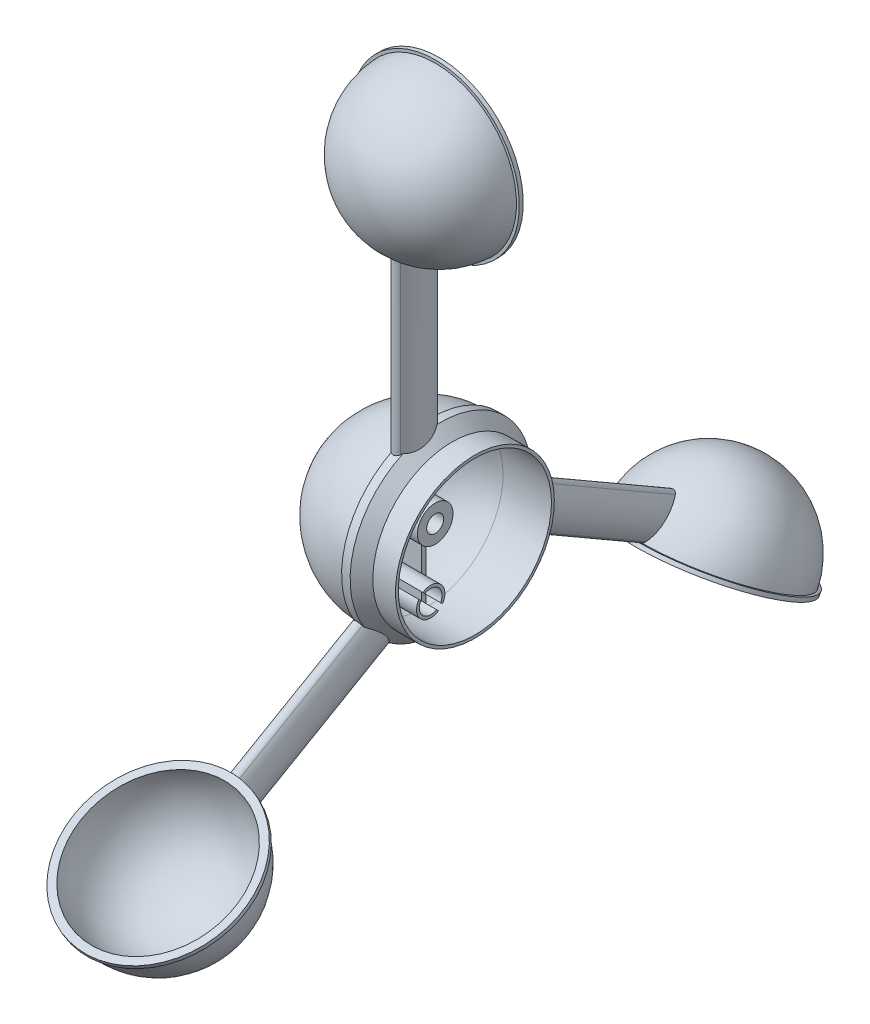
from build123d import *

# Parameters (mm, degrees)
LOGEMENT_AIMANT_REACH          = 35.522
ESQUISSE6_R                    = 2.5
ESQUISSE6_R_2                  = 2
RAINURE_DEPTH                  = 10
MOYEU_D_AXE_REACH              = 30.748
MOYEU_D_AXE_END_RADIUS         = 12.701536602
ESQUISSE8_R                    = 3.15
NERVURE_REACH                  = 29.56
R_P_TITION_NERVURE_COUNT       = 2
R_P_TITION_NERVURE_ANGLE       = 150
BRAS_DEPTH                     = 33
ESQUISSE5_R                    = 13.9
LOGEMENT_DE_LA_COUPELLE_DEPTH  = 5
R_P_TITION_DES_BRAS_COUNT      = 3
R_P_TITION_DES_COUPELLES_COUNT = 3
ESQUISSE9_R                    = 1.5
AXE_3_DEPTH                    = 15
MATI_RE1_POUR_VIS_REACH        = 101.071
ESQUISSE13_R                   = 3.75
ESQUISSE15_R                   = 0.75
PERCAGE_TROU_D_EAU_DEPTH       = 40
R_P_TITION_CIRCULAIRE1_COUNT   = 3


with BuildPart() as part:
    # Esquisse1 → moyeu (revolve)
    with BuildSketch(Plane.XY, mode=Mode.PRIVATE) as moyeu_sk:
        with BuildLine():
            Line((0, 13.5), (0, 14))
            Line((0, 14), (-4, 14))
            Line((-4, 14), (-6, 16))
            Line((-6, 16), (-7.5, 16))
            Line((-7.5, 16), (-7.5, 15.5))
            ThreePointArc((-7.5, 15.5), (-15.925144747, 13.778968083), (-22.339049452, 8.051242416))
            ThreePointArc((-22.339049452, 8.051242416), (-24.122171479, 4.199871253), (-24.733453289, 0))
            Line((-24.733453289, 0), (-22.701536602, 0))
            ThreePointArc((-22.701536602, 0), (-22.174557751, 3.620659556), (-20.637349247, 6.940881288))
            ThreePointArc((-20.637349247, 6.940881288), (-15.412478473, 11.754936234), (-8.525595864, 13.5))
            Line((-8.525595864, 13.5), (0, 13.5))
        make_face()
    revolve(moyeu_sk.sketch.rotate(Axis((0, 0, 0), (-1, 0, 0)), 90), axis=Axis((0, 0, 0), (-1, 0, 0)))

    # Esquisse6 → logement aimant (add, up to next)
    with BuildSketch(Plane(origin=(0, 0, 0), x_dir=(0, 0, -1), z_dir=(1, 0, 0)), mode=Mode.PRIVATE) as logement_aimant_sk1:
        with Locations((-7.794228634, -4.5)):
            Circle(ESQUISSE6_R)
        with Locations((-7.794228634, -4.5)):
            Circle(ESQUISSE6_R_2, mode=Mode.SUBTRACT)
    logement_aimant_tool1 = extrude(logement_aimant_sk1.sketch, amount=-LOGEMENT_AIMANT_REACH, mode=Mode.PRIVATE) - part.part
    add(logement_aimant_tool1.solids().sort_by_distance((0, -4.5, 10.223518))[0])

    # Esquisse7 → rainure (cut)
    with BuildSketch(Plane(origin=(0, 0, 0), x_dir=(0, 0, -1), z_dir=(1, 0, 0))):
        Polygon((-10.036201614, -2.965133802), (-5.793560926, -7.207774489), (-5.086454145, -6.500667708), (-9.329094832, -2.258027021), align=None)
    extrude(amount=-RAINURE_DEPTH, mode=Mode.SUBTRACT)

    # moyeu d_axe: up to this sphere (the profile starts inside it)
    moyeu_d_axe_end = Location((-10, 0, 0)) * Sphere(MOYEU_D_AXE_END_RADIUS, mode=Mode.PRIVATE)
    # Esquisse8 → moyeu d_axe (add, up to the surface)
    with BuildSketch(Plane(origin=(-7, 0, 0), x_dir=(0, 0, -1), z_dir=(1, 0, 0)), mode=Mode.PRIVATE) as moyeu_d_axe_sk1:
        Circle(ESQUISSE8_R)
    moyeu_d_axe_tool1 = extrude(moyeu_d_axe_sk1.sketch, amount=-MOYEU_D_AXE_REACH, mode=Mode.PRIVATE) & moyeu_d_axe_end
    add(moyeu_d_axe_tool1.solids().sort_by_distance((-7, 0, 0))[0])

    # Esquisse10 → nervure (add, up to next)
    with BuildSketch(Plane(origin=(-9, 0, 0), x_dir=(0, 0, -1), z_dir=(1, 0, 0)), mode=Mode.PRIVATE) as nervure_sk1:
        Polygon((-1.48724054, 1.776825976), (-7.228464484, 11.720917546), (-6.535644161, 12.120917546), (-0.81287182, 2.208785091), align=None)
    nervure_tool1 = extrude(nervure_sk1.sketch, amount=-NERVURE_REACH, mode=Mode.PRIVATE) - part.part
    nervure = nervure_tool1.solids().sort_by_distance((-9, 6.95675, 4.016239))[0]
    add(nervure)

    # R_p_tition nervure: nervure ×2 about axis
    r_p_tition_nervure_axis = Axis((-500000, 0, 0), (1, 0, 0))
    for i in range(1, R_P_TITION_NERVURE_COUNT):
        add(nervure.rotate(r_p_tition_nervure_axis, i * R_P_TITION_NERVURE_ANGLE / (R_P_TITION_NERVURE_COUNT - 1)))

    # Esquisse2 → bras (add)
    with BuildSketch(Plane(origin=(0, 13.5, 0), x_dir=(-1, 0, 0), z_dir=(0, 1, 0))):
        with BuildLine():
            ThreePointArc((7.839224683, 6.943784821), (7.015144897, 7.399885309), (6.177629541, 6.968952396))
            ThreePointArc((6.177629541, 6.968952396), (5.152076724, 3.684077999), (6.177629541, 0.399203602))
            ThreePointArc((6.177629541, 0.399203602), (7.015144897, -0.031729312), (7.839224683, 0.424371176))
            ThreePointArc((7.839224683, 0.424371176), (8.55121093, 1.984576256), (8.781119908, 3.684077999))
            ThreePointArc((8.781119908, 3.684077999), (8.55121093, 5.383579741), (7.839224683, 6.943784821))
        make_face()
    bras = extrude(amount=BRAS_DEPTH)

    # Esquisse5 → logement de la coupelle (cut, symmetric)
    with BuildSketch(Plane(origin=(-7, 0, 0), x_dir=(0, 0, -1), z_dir=(1, 0, 0))):
        with Locations((0, 56)):
            Circle(ESQUISSE5_R)
    logement_de_la_coupelle = extrude(amount=LOGEMENT_DE_LA_COUPELLE_DEPTH, both=True, mode=Mode.SUBTRACT)

    # R_p_tition des bras: bras, logement de la coupelle ×3 about axis
    r_p_tition_des_bras_axis = Axis((0, 0, 0), (1, 0, 0))
    add([bras.rotate(r_p_tition_des_bras_axis, i * 360 / R_P_TITION_DES_BRAS_COUNT) for i in range(1, R_P_TITION_DES_BRAS_COUNT)])
    add([logement_de_la_coupelle.rotate(r_p_tition_des_bras_axis, i * 360 / R_P_TITION_DES_BRAS_COUNT) for i in range(1, R_P_TITION_DES_BRAS_COUNT)], mode=Mode.SUBTRACT)

    # Esquisse3 → coupelle (revolve)
    with BuildSketch(Plane(origin=(-7, 0, 0), x_dir=(0, 0, -1), z_dir=(1, 0, 0))):
        with BuildLine():
            Line((0, 70.32702487), (0, 70.827050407))
            Line((0, 70.827050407), (0.69999966, 70.827739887))
            Line((0.69999966, 70.827739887), (0.69999966, 69.5))
            ThreePointArc((0.69999966, 69.5), (-8.845941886, 65.545941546), (-12.80000034, 56))
            Line((-12.80000034, 56), (-13.644115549, 56))
            ThreePointArc((-13.644115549, 56), (-9.687360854, 65.892238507), (0, 70.32702487))
        make_face()
    coupelle = revolve(axis=Axis((-7, 56, 12.80000034), (0, 0, 1)))

    # R_p_tition des coupelles: coupelle ×3 about axis
    r_p_tition_des_coupelles_axis = Axis((0, 0, 0), (1, 0, 0))
    for i in range(1, R_P_TITION_DES_COUPELLES_COUNT):
        add(coupelle.rotate(r_p_tition_des_coupelles_axis, i * 360 / R_P_TITION_DES_COUPELLES_COUNT))

    # Esquisse9 → axe 3 (cut)
    with BuildSketch(Plane(origin=(-7, 0, 0), x_dir=(0, 0, -1), z_dir=(1, 0, 0))):
        Circle(ESQUISSE9_R)
    extrude(amount=-AXE_3_DEPTH, mode=Mode.SUBTRACT)

    # Esquisse12 → mati_re pour vis (revolve)
    with BuildSketch(Plane(origin=(-17, 0, 0), x_dir=(0, 0, -1), z_dir=(1, 0, 0)), mode=Mode.PRIVATE) as mati_re_pour_vis_sk:
        Polygon((0.269339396, 3.042254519), (6.156606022, 6.44126949), (7.406606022, 4.276205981), (1.519339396, 0.877191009), align=None)
    revolve(mati_re_pour_vis_sk.sketch.rotate(Axis((-17, 0, 0), (0, 0.5000000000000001, -0.8660254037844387)), 230.949877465), axis=Axis((-17, 0, 0), (0, 0.5000000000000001, -0.8660254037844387)))

    # Esquisse13 → mati_re1 pour vis (add, up to next)
    with BuildSketch(Plane(origin=(0, 4.276205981, -7.406606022), x_dir=(-1, 0, 0), z_dir=(0, 0.5000000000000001, -0.8660254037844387)), mode=Mode.PRIVATE) as mati_re1_pour_vis_sk1:
        with Locations((17, 0)):
            Circle(ESQUISSE13_R)
    mati_re1_pour_vis_tool1 = extrude(mati_re1_pour_vis_sk1.sketch, amount=MATI_RE1_POUR_VIS_REACH, mode=Mode.PRIVATE) - part.part
    add(mati_re1_pour_vis_tool1.solids().sort_by_distance((-17, 4.276206, -7.406606))[0])

    # Esquisse14 → vis de fixation (revolve, cut)
    with BuildSketch(Plane(origin=(-17, 0, 0), x_dir=(0, 0, -1), z_dir=(1, 0, 0))):
        Polygon((0, 0), (-0.75, 1.299038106), (7.910254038, 6.299038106), (7.160254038, 7.598076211), (14.286011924, 11.712134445), (15.786011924, 9.114058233), align=None)
    revolve(axis=Axis((-17, 9.114058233, -15.786011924), (0, -0.4999999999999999, 0.8660254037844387)), mode=Mode.SUBTRACT)

    # Esquisse15 → percage trou d_eau (cut)
    with BuildSketch(Plane(origin=(0, 0, 0), x_dir=(0, 0, -1), z_dir=(1, 0, 0))):
        with Locations(Location((-3.637306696, -2.1, 0), (0, 0, 330.65949921))):
            Circle(ESQUISSE15_R)
    percage_trou_d_eau = extrude(amount=-PERCAGE_TROU_D_EAU_DEPTH, mode=Mode.SUBTRACT)

    # R_p_tition circulaire1: percage trou d_eau ×3 about axis
    r_p_tition_circulaire1_axis = Axis((0, 0, 0), (1, 0, 0))
    for i in range(1, R_P_TITION_CIRCULAIRE1_COUNT):
        add(percage_trou_d_eau.rotate(r_p_tition_circulaire1_axis, i * 360 / R_P_TITION_CIRCULAIRE1_COUNT), mode=Mode.SUBTRACT)


solid = part.part
